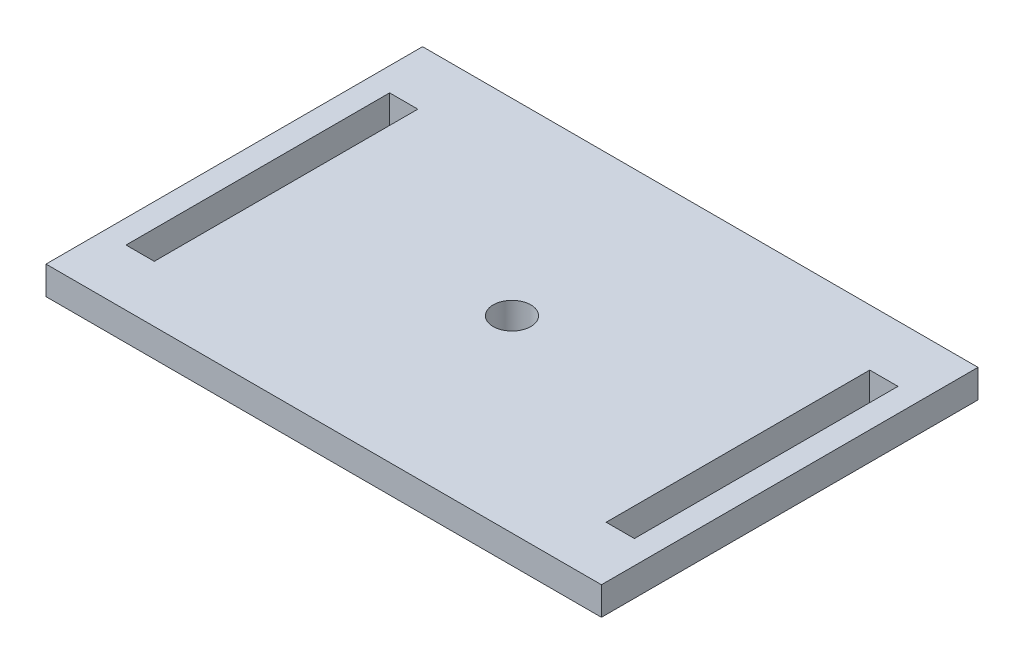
ISO-10303-21;
HEADER;
FILE_DESCRIPTION(('STEP AP214'),'2;1');
FILE_NAME('part.step','',(''),(''),'','','');
FILE_SCHEMA(('AUTOMOTIVE_DESIGN { 1 0 10303 214 1 1 1 1 }'));
ENDSEC;
DATA;
#1=APPLICATION_CONTEXT('core data for automotive mechanical design processes');
#2=APPLICATION_PROTOCOL_DEFINITION('international standard','automotive_design',2000,#1);
#3=PRODUCT_CONTEXT('',#1,'mechanical');
#4=PRODUCT('Part','Part','',(#3));
#5=PRODUCT_RELATED_PRODUCT_CATEGORY('part','',(#4));
#6=PRODUCT_DEFINITION_FORMATION('','',#4);
#7=PRODUCT_DEFINITION_CONTEXT('part definition',#1,'design');
#8=PRODUCT_DEFINITION('design','',#6,#7);
#9=PRODUCT_DEFINITION_SHAPE('','',#8);
#10=(LENGTH_UNIT() NAMED_UNIT(*) SI_UNIT(.MILLI.,.METRE.));
#11=(NAMED_UNIT(*) PLANE_ANGLE_UNIT() SI_UNIT($,.RADIAN.));
#12=(NAMED_UNIT(*) SI_UNIT($,.STERADIAN.) SOLID_ANGLE_UNIT());
#13=UNCERTAINTY_MEASURE_WITH_UNIT(LENGTH_MEASURE(1.E-05),#10,'distance_accuracy_value','');
#14=(GEOMETRIC_REPRESENTATION_CONTEXT(3) GLOBAL_UNCERTAINTY_ASSIGNED_CONTEXT((#13)) GLOBAL_UNIT_ASSIGNED_CONTEXT((#10,
#11,#12)) REPRESENTATION_CONTEXT('',''));
#15=CARTESIAN_POINT('',(0.,0.,0.));
#16=DIRECTION('',(0.,0.,1.));
#17=DIRECTION('',(1.,0.,0.));
#18=AXIS2_PLACEMENT_3D('',#15,#16,#17);
#19=CARTESIAN_POINT('',(29.5,3.,20.));
#20=DIRECTION('',(0.,1.,0.));
#21=DIRECTION('',(0.,0.,1.));
#22=AXIS2_PLACEMENT_3D('',#19,#20,#21);
#23=PLANE('',#22);
#24=DIRECTION('',(-1.,0.,0.));
#25=VECTOR('',#24,1.);
#26=CARTESIAN_POINT('',(-27.,3.,-14.));
#27=LINE('',#26,#25);
#28=CARTESIAN_POINT('',(-24.,3.,-14.));
#29=VERTEX_POINT('',#28);
#30=CARTESIAN_POINT('',(-27.,3.,-14.));
#31=VERTEX_POINT('',#30);
#32=EDGE_CURVE('E160',#29,#31,#27,.T.);
#33=ORIENTED_EDGE('',*,*,#32,.F.);
#34=DIRECTION('',(0.,0.,-1.));
#35=VECTOR('',#34,1.);
#36=CARTESIAN_POINT('',(-24.,3.,-14.));
#37=LINE('',#36,#35);
#38=CARTESIAN_POINT('',(-24.,3.,14.));
#39=VERTEX_POINT('',#38);
#40=EDGE_CURVE('E158',#39,#29,#37,.T.);
#41=ORIENTED_EDGE('',*,*,#40,.F.);
#42=DIRECTION('',(1.,0.,0.));
#43=VECTOR('',#42,1.);
#44=CARTESIAN_POINT('',(-27.,3.,14.));
#45=LINE('',#44,#43);
#46=CARTESIAN_POINT('',(-27.,3.,14.));
#47=VERTEX_POINT('',#46);
#48=EDGE_CURVE('E166',#47,#39,#45,.T.);
#49=ORIENTED_EDGE('',*,*,#48,.F.);
#50=DIRECTION('',(0.,0.,1.));
#51=VECTOR('',#50,1.);
#52=CARTESIAN_POINT('',(-27.,3.,-14.));
#53=LINE('',#52,#51);
#54=EDGE_CURVE('E163',#31,#47,#53,.T.);
#55=ORIENTED_EDGE('',*,*,#54,.F.);
#56=EDGE_LOOP('',(#33,#41,#49,#55));
#57=FACE_BOUND('',#56,.T.);
#58=DIRECTION('',(0.,0.,-1.));
#59=VECTOR('',#58,1.);
#60=CARTESIAN_POINT('',(29.5,3.,-20.));
#61=LINE('',#60,#59);
#62=CARTESIAN_POINT('',(29.5,3.,20.));
#63=VERTEX_POINT('',#62);
#64=CARTESIAN_POINT('',(29.5,3.,-20.));
#65=VERTEX_POINT('',#64);
#66=EDGE_CURVE('E195',#63,#65,#61,.T.);
#67=ORIENTED_EDGE('',*,*,#66,.T.);
#68=DIRECTION('',(-1.,0.,0.));
#69=VECTOR('',#68,1.);
#70=CARTESIAN_POINT('',(-29.5,3.,-20.));
#71=LINE('',#70,#69);
#72=CARTESIAN_POINT('',(-29.5,3.,-20.));
#73=VERTEX_POINT('',#72);
#74=EDGE_CURVE('E198',#65,#73,#71,.T.);
#75=ORIENTED_EDGE('',*,*,#74,.T.);
#76=DIRECTION('',(0.,0.,1.));
#77=VECTOR('',#76,1.);
#78=CARTESIAN_POINT('',(-29.5,3.,-20.));
#79=LINE('',#78,#77);
#80=CARTESIAN_POINT('',(-29.5,3.,20.));
#81=VERTEX_POINT('',#80);
#82=EDGE_CURVE('E201',#73,#81,#79,.T.);
#83=ORIENTED_EDGE('',*,*,#82,.T.);
#84=DIRECTION('',(1.,0.,0.));
#85=VECTOR('',#84,1.);
#86=CARTESIAN_POINT('',(-29.5,3.,20.));
#87=LINE('',#86,#85);
#88=EDGE_CURVE('E203',#81,#63,#87,.T.);
#89=ORIENTED_EDGE('',*,*,#88,.T.);
#90=EDGE_LOOP('',(#67,#75,#83,#89));
#91=FACE_BOUND('',#90,.T.);
#92=CARTESIAN_POINT('',(0.,3.,0.));
#93=DIRECTION('',(0.,1.,0.));
#94=DIRECTION('',(0.,0.,1.));
#95=AXIS2_PLACEMENT_3D('',#92,#93,#94);
#96=CIRCLE('',#95,2.);
#97=CARTESIAN_POINT('',(0.,3.,2.));
#98=VERTEX_POINT('',#97);
#99=EDGE_CURVE('E189',#98,#98,#96,.T.);
#100=ORIENTED_EDGE('',*,*,#99,.F.);
#101=EDGE_LOOP('',(#100));
#102=FACE_BOUND('',#101,.T.);
#103=DIRECTION('',(-1.,0.,0.));
#104=VECTOR('',#103,1.);
#105=CARTESIAN_POINT('',(27.,3.,-14.));
#106=LINE('',#105,#104);
#107=CARTESIAN_POINT('',(27.,3.,-14.));
#108=VERTEX_POINT('',#107);
#109=CARTESIAN_POINT('',(24.,3.,-14.));
#110=VERTEX_POINT('',#109);
#111=EDGE_CURVE('E130',#108,#110,#106,.T.);
#112=ORIENTED_EDGE('',*,*,#111,.F.);
#113=DIRECTION('',(0.,0.,-1.));
#114=VECTOR('',#113,1.);
#115=CARTESIAN_POINT('',(27.,3.,-14.));
#116=LINE('',#115,#114);
#117=CARTESIAN_POINT('',(27.,3.,14.));
#118=VERTEX_POINT('',#117);
#119=EDGE_CURVE('E122',#118,#108,#116,.T.);
#120=ORIENTED_EDGE('',*,*,#119,.F.);
#121=DIRECTION('',(1.,0.,0.));
#122=VECTOR('',#121,1.);
#123=CARTESIAN_POINT('',(27.,3.,14.));
#124=LINE('',#123,#122);
#125=CARTESIAN_POINT('',(24.,3.,14.));
#126=VERTEX_POINT('',#125);
#127=EDGE_CURVE('E144',#126,#118,#124,.T.);
#128=ORIENTED_EDGE('',*,*,#127,.F.);
#129=DIRECTION('',(0.,0.,1.));
#130=VECTOR('',#129,1.);
#131=CARTESIAN_POINT('',(24.,3.,-14.));
#132=LINE('',#131,#130);
#133=EDGE_CURVE('E142',#110,#126,#132,.T.);
#134=ORIENTED_EDGE('',*,*,#133,.F.);
#135=EDGE_LOOP('',(#112,#120,#128,#134));
#136=FACE_BOUND('',#135,.T.);
#137=ADVANCED_FACE('F33',(#57,#91,#102,#136),#23,.T.);
#138=CARTESIAN_POINT('',(29.5,0.,20.));
#139=DIRECTION('',(0.,1.,0.));
#140=DIRECTION('',(0.,0.,1.));
#141=AXIS2_PLACEMENT_3D('',#138,#139,#140);
#142=PLANE('',#141);
#143=DIRECTION('',(0.,0.,-1.));
#144=VECTOR('',#143,1.);
#145=CARTESIAN_POINT('',(-24.,0.,-14.));
#146=LINE('',#145,#144);
#147=CARTESIAN_POINT('',(-24.,0.,14.));
#148=VERTEX_POINT('',#147);
#149=CARTESIAN_POINT('',(-24.,0.,-14.));
#150=VERTEX_POINT('',#149);
#151=EDGE_CURVE('E138',#148,#150,#146,.T.);
#152=ORIENTED_EDGE('',*,*,#151,.T.);
#153=DIRECTION('',(-1.,0.,0.));
#154=VECTOR('',#153,1.);
#155=CARTESIAN_POINT('',(-27.,0.,-14.));
#156=LINE('',#155,#154);
#157=CARTESIAN_POINT('',(-27.,0.,-14.));
#158=VERTEX_POINT('',#157);
#159=EDGE_CURVE('E171',#150,#158,#156,.T.);
#160=ORIENTED_EDGE('',*,*,#159,.T.);
#161=DIRECTION('',(0.,0.,1.));
#162=VECTOR('',#161,1.);
#163=CARTESIAN_POINT('',(-27.,0.,-14.));
#164=LINE('',#163,#162);
#165=CARTESIAN_POINT('',(-27.,0.,14.));
#166=VERTEX_POINT('',#165);
#167=EDGE_CURVE('E174',#158,#166,#164,.T.);
#168=ORIENTED_EDGE('',*,*,#167,.T.);
#169=DIRECTION('',(1.,0.,0.));
#170=VECTOR('',#169,1.);
#171=CARTESIAN_POINT('',(-27.,0.,14.));
#172=LINE('',#171,#170);
#173=EDGE_CURVE('E161',#166,#148,#172,.T.);
#174=ORIENTED_EDGE('',*,*,#173,.T.);
#175=EDGE_LOOP('',(#152,#160,#168,#174));
#176=FACE_BOUND('',#175,.T.);
#177=DIRECTION('',(0.,0.,-1.));
#178=VECTOR('',#177,1.);
#179=CARTESIAN_POINT('',(29.5,0.,-20.));
#180=LINE('',#179,#178);
#181=CARTESIAN_POINT('',(29.5,0.,20.));
#182=VERTEX_POINT('',#181);
#183=CARTESIAN_POINT('',(29.5,0.,-20.));
#184=VERTEX_POINT('',#183);
#185=EDGE_CURVE('E192',#182,#184,#180,.T.);
#186=ORIENTED_EDGE('',*,*,#185,.F.);
#187=DIRECTION('',(1.,0.,0.));
#188=VECTOR('',#187,1.);
#189=CARTESIAN_POINT('',(-29.5,0.,20.));
#190=LINE('',#189,#188);
#191=CARTESIAN_POINT('',(-29.5,0.,20.));
#192=VERTEX_POINT('',#191);
#193=EDGE_CURVE('E199',#192,#182,#190,.T.);
#194=ORIENTED_EDGE('',*,*,#193,.F.);
#195=DIRECTION('',(0.,0.,1.));
#196=VECTOR('',#195,1.);
#197=CARTESIAN_POINT('',(-29.5,0.,-20.));
#198=LINE('',#197,#196);
#199=CARTESIAN_POINT('',(-29.5,0.,-20.));
#200=VERTEX_POINT('',#199);
#201=EDGE_CURVE('E210',#200,#192,#198,.T.);
#202=ORIENTED_EDGE('',*,*,#201,.F.);
#203=DIRECTION('',(-1.,0.,0.));
#204=VECTOR('',#203,1.);
#205=CARTESIAN_POINT('',(-29.5,0.,-20.));
#206=LINE('',#205,#204);
#207=EDGE_CURVE('E208',#184,#200,#206,.T.);
#208=ORIENTED_EDGE('',*,*,#207,.F.);
#209=EDGE_LOOP('',(#186,#194,#202,#208));
#210=FACE_BOUND('',#209,.T.);
#211=CARTESIAN_POINT('',(0.,0.,0.));
#212=DIRECTION('',(0.,1.,0.));
#213=DIRECTION('',(0.,0.,1.));
#214=AXIS2_PLACEMENT_3D('',#211,#212,#213);
#215=CIRCLE('',#214,2.);
#216=CARTESIAN_POINT('',(0.,0.,2.));
#217=VERTEX_POINT('',#216);
#218=EDGE_CURVE('E188',#217,#217,#215,.T.);
#219=ORIENTED_EDGE('',*,*,#218,.T.);
#220=EDGE_LOOP('',(#219));
#221=FACE_BOUND('',#220,.T.);
#222=DIRECTION('',(0.,0.,-1.));
#223=VECTOR('',#222,1.);
#224=CARTESIAN_POINT('',(27.,0.,-14.));
#225=LINE('',#224,#223);
#226=CARTESIAN_POINT('',(27.,0.,14.));
#227=VERTEX_POINT('',#226);
#228=CARTESIAN_POINT('',(27.,0.,-14.));
#229=VERTEX_POINT('',#228);
#230=EDGE_CURVE('E56',#227,#229,#225,.T.);
#231=ORIENTED_EDGE('',*,*,#230,.T.);
#232=DIRECTION('',(-1.,0.,0.));
#233=VECTOR('',#232,1.);
#234=CARTESIAN_POINT('',(27.,0.,-14.));
#235=LINE('',#234,#233);
#236=CARTESIAN_POINT('',(24.,0.,-14.));
#237=VERTEX_POINT('',#236);
#238=EDGE_CURVE('E137',#229,#237,#235,.T.);
#239=ORIENTED_EDGE('',*,*,#238,.T.);
#240=DIRECTION('',(0.,0.,1.));
#241=VECTOR('',#240,1.);
#242=CARTESIAN_POINT('',(24.,0.,-14.));
#243=LINE('',#242,#241);
#244=CARTESIAN_POINT('',(24.,0.,14.));
#245=VERTEX_POINT('',#244);
#246=EDGE_CURVE('E150',#237,#245,#243,.T.);
#247=ORIENTED_EDGE('',*,*,#246,.T.);
#248=DIRECTION('',(1.,0.,0.));
#249=VECTOR('',#248,1.);
#250=CARTESIAN_POINT('',(27.,0.,14.));
#251=LINE('',#250,#249);
#252=EDGE_CURVE('E131',#245,#227,#251,.T.);
#253=ORIENTED_EDGE('',*,*,#252,.T.);
#254=EDGE_LOOP('',(#231,#239,#247,#253));
#255=FACE_BOUND('',#254,.T.);
#256=ADVANCED_FACE('F228',(#176,#210,#221,#255),#142,.F.);
#257=CARTESIAN_POINT('',(29.5,3.,-20.));
#258=DIRECTION('',(-1.,0.,0.));
#259=DIRECTION('',(0.,0.,1.));
#260=AXIS2_PLACEMENT_3D('',#257,#258,#259);
#261=PLANE('',#260);
#262=ORIENTED_EDGE('',*,*,#185,.T.);
#263=DIRECTION('',(0.,-1.,0.));
#264=VECTOR('',#263,1.);
#265=CARTESIAN_POINT('',(29.5,3.,-20.));
#266=LINE('',#265,#264);
#267=EDGE_CURVE('E11',#65,#184,#266,.T.);
#268=ORIENTED_EDGE('',*,*,#267,.F.);
#269=ORIENTED_EDGE('',*,*,#66,.F.);
#270=DIRECTION('',(0.,-1.,0.));
#271=VECTOR('',#270,1.);
#272=CARTESIAN_POINT('',(29.5,3.,20.));
#273=LINE('',#272,#271);
#274=EDGE_CURVE('E205',#63,#182,#273,.T.);
#275=ORIENTED_EDGE('',*,*,#274,.T.);
#276=EDGE_LOOP('',(#262,#268,#269,#275));
#277=FACE_BOUND('',#276,.T.);
#278=ADVANCED_FACE('F35',(#277),#261,.F.);
#279=CARTESIAN_POINT('',(-29.5,3.,-20.));
#280=DIRECTION('',(0.,0.,1.));
#281=DIRECTION('',(1.,0.,0.));
#282=AXIS2_PLACEMENT_3D('',#279,#280,#281);
#283=PLANE('',#282);
#284=ORIENTED_EDGE('',*,*,#207,.T.);
#285=DIRECTION('',(0.,-1.,0.));
#286=VECTOR('',#285,1.);
#287=CARTESIAN_POINT('',(-29.5,3.,-20.));
#288=LINE('',#287,#286);
#289=EDGE_CURVE('E41',#73,#200,#288,.T.);
#290=ORIENTED_EDGE('',*,*,#289,.F.);
#291=ORIENTED_EDGE('',*,*,#74,.F.);
#292=ORIENTED_EDGE('',*,*,#267,.T.);
#293=EDGE_LOOP('',(#284,#290,#291,#292));
#294=FACE_BOUND('',#293,.T.);
#295=ADVANCED_FACE('F239',(#294),#283,.F.);
#296=CARTESIAN_POINT('',(-29.5,3.,-20.));
#297=DIRECTION('',(1.,0.,0.));
#298=DIRECTION('',(0.,0.,-1.));
#299=AXIS2_PLACEMENT_3D('',#296,#297,#298);
#300=PLANE('',#299);
#301=ORIENTED_EDGE('',*,*,#201,.T.);
#302=DIRECTION('',(0.,-1.,0.));
#303=VECTOR('',#302,1.);
#304=CARTESIAN_POINT('',(-29.5,3.,20.));
#305=LINE('',#304,#303);
#306=EDGE_CURVE('E215',#81,#192,#305,.T.);
#307=ORIENTED_EDGE('',*,*,#306,.F.);
#308=ORIENTED_EDGE('',*,*,#82,.F.);
#309=ORIENTED_EDGE('',*,*,#289,.T.);
#310=EDGE_LOOP('',(#301,#307,#308,#309));
#311=FACE_BOUND('',#310,.T.);
#312=ADVANCED_FACE('F222',(#311),#300,.F.);
#313=CARTESIAN_POINT('',(-29.5,3.,20.));
#314=DIRECTION('',(0.,0.,-1.));
#315=DIRECTION('',(-1.,0.,0.));
#316=AXIS2_PLACEMENT_3D('',#313,#314,#315);
#317=PLANE('',#316);
#318=ORIENTED_EDGE('',*,*,#193,.T.);
#319=ORIENTED_EDGE('',*,*,#274,.F.);
#320=ORIENTED_EDGE('',*,*,#88,.F.);
#321=ORIENTED_EDGE('',*,*,#306,.T.);
#322=EDGE_LOOP('',(#318,#319,#320,#321));
#323=FACE_BOUND('',#322,.T.);
#324=ADVANCED_FACE('F232',(#323),#317,.F.);
#325=CARTESIAN_POINT('',(0.,3.,0.));
#326=DIRECTION('',(0.,-1.,0.));
#327=DIRECTION('',(0.,0.,-1.));
#328=AXIS2_PLACEMENT_3D('',#325,#326,#327);
#329=CYLINDRICAL_SURFACE('',#328,2.);
#330=ORIENTED_EDGE('',*,*,#99,.T.);
#331=EDGE_LOOP('',(#330));
#332=FACE_BOUND('',#331,.T.);
#333=ORIENTED_EDGE('',*,*,#218,.F.);
#334=EDGE_LOOP('',(#333));
#335=FACE_BOUND('',#334,.T.);
#336=ADVANCED_FACE('F256',(#332,#335),#329,.F.);
#337=CARTESIAN_POINT('',(-24.,3.,-14.));
#338=DIRECTION('',(-1.,0.,0.));
#339=DIRECTION('',(0.,0.,1.));
#340=AXIS2_PLACEMENT_3D('',#337,#338,#339);
#341=PLANE('',#340);
#342=ORIENTED_EDGE('',*,*,#151,.F.);
#343=DIRECTION('',(0.,-1.,0.));
#344=VECTOR('',#343,1.);
#345=CARTESIAN_POINT('',(-24.,3.,14.));
#346=LINE('',#345,#344);
#347=EDGE_CURVE('E168',#39,#148,#346,.T.);
#348=ORIENTED_EDGE('',*,*,#347,.F.);
#349=ORIENTED_EDGE('',*,*,#40,.T.);
#350=DIRECTION('',(0.,-1.,0.));
#351=VECTOR('',#350,1.);
#352=CARTESIAN_POINT('',(-24.,3.,-14.));
#353=LINE('',#352,#351);
#354=EDGE_CURVE('E185',#29,#150,#353,.T.);
#355=ORIENTED_EDGE('',*,*,#354,.T.);
#356=EDGE_LOOP('',(#342,#348,#349,#355));
#357=FACE_BOUND('',#356,.T.);
#358=ADVANCED_FACE('F263',(#357),#341,.T.);
#359=CARTESIAN_POINT('',(-27.,3.,-14.));
#360=DIRECTION('',(0.,0.,1.));
#361=DIRECTION('',(1.,0.,0.));
#362=AXIS2_PLACEMENT_3D('',#359,#360,#361);
#363=PLANE('',#362);
#364=ORIENTED_EDGE('',*,*,#159,.F.);
#365=ORIENTED_EDGE('',*,*,#354,.F.);
#366=ORIENTED_EDGE('',*,*,#32,.T.);
#367=DIRECTION('',(0.,-1.,0.));
#368=VECTOR('',#367,1.);
#369=CARTESIAN_POINT('',(-27.,3.,-14.));
#370=LINE('',#369,#368);
#371=EDGE_CURVE('E183',#31,#158,#370,.T.);
#372=ORIENTED_EDGE('',*,*,#371,.T.);
#373=EDGE_LOOP('',(#364,#365,#366,#372));
#374=FACE_BOUND('',#373,.T.);
#375=ADVANCED_FACE('F268',(#374),#363,.T.);
#376=CARTESIAN_POINT('',(-27.,3.,-14.));
#377=DIRECTION('',(1.,0.,0.));
#378=DIRECTION('',(0.,0.,-1.));
#379=AXIS2_PLACEMENT_3D('',#376,#377,#378);
#380=PLANE('',#379);
#381=ORIENTED_EDGE('',*,*,#167,.F.);
#382=ORIENTED_EDGE('',*,*,#371,.F.);
#383=ORIENTED_EDGE('',*,*,#54,.T.);
#384=DIRECTION('',(0.,-1.,0.));
#385=VECTOR('',#384,1.);
#386=CARTESIAN_POINT('',(-27.,3.,14.));
#387=LINE('',#386,#385);
#388=EDGE_CURVE('E181',#47,#166,#387,.T.);
#389=ORIENTED_EDGE('',*,*,#388,.T.);
#390=EDGE_LOOP('',(#381,#382,#383,#389));
#391=FACE_BOUND('',#390,.T.);
#392=ADVANCED_FACE('F292',(#391),#380,.T.);
#393=CARTESIAN_POINT('',(-27.,3.,14.));
#394=DIRECTION('',(0.,0.,-1.));
#395=DIRECTION('',(-1.,0.,0.));
#396=AXIS2_PLACEMENT_3D('',#393,#394,#395);
#397=PLANE('',#396);
#398=ORIENTED_EDGE('',*,*,#173,.F.);
#399=ORIENTED_EDGE('',*,*,#388,.F.);
#400=ORIENTED_EDGE('',*,*,#48,.T.);
#401=ORIENTED_EDGE('',*,*,#347,.T.);
#402=EDGE_LOOP('',(#398,#399,#400,#401));
#403=FACE_BOUND('',#402,.T.);
#404=ADVANCED_FACE('F289',(#403),#397,.T.);
#405=CARTESIAN_POINT('',(27.,3.,-14.));
#406=DIRECTION('',(-1.,0.,0.));
#407=DIRECTION('',(0.,0.,1.));
#408=AXIS2_PLACEMENT_3D('',#405,#406,#407);
#409=PLANE('',#408);
#410=ORIENTED_EDGE('',*,*,#230,.F.);
#411=DIRECTION('',(0.,-1.,0.));
#412=VECTOR('',#411,1.);
#413=CARTESIAN_POINT('',(27.,3.,14.));
#414=LINE('',#413,#412);
#415=EDGE_CURVE('E126',#118,#227,#414,.T.);
#416=ORIENTED_EDGE('',*,*,#415,.F.);
#417=ORIENTED_EDGE('',*,*,#119,.T.);
#418=DIRECTION('',(0.,-1.,0.));
#419=VECTOR('',#418,1.);
#420=CARTESIAN_POINT('',(27.,3.,-14.));
#421=LINE('',#420,#419);
#422=EDGE_CURVE('E125',#108,#229,#421,.T.);
#423=ORIENTED_EDGE('',*,*,#422,.T.);
#424=EDGE_LOOP('',(#410,#416,#417,#423));
#425=FACE_BOUND('',#424,.T.);
#426=ADVANCED_FACE('F124',(#425),#409,.T.);
#427=CARTESIAN_POINT('',(27.,3.,-14.));
#428=DIRECTION('',(0.,0.,1.));
#429=DIRECTION('',(1.,0.,0.));
#430=AXIS2_PLACEMENT_3D('',#427,#428,#429);
#431=PLANE('',#430);
#432=ORIENTED_EDGE('',*,*,#238,.F.);
#433=ORIENTED_EDGE('',*,*,#422,.F.);
#434=ORIENTED_EDGE('',*,*,#111,.T.);
#435=DIRECTION('',(0.,-1.,0.));
#436=VECTOR('',#435,1.);
#437=CARTESIAN_POINT('',(24.,3.,-14.));
#438=LINE('',#437,#436);
#439=EDGE_CURVE('E139',#110,#237,#438,.T.);
#440=ORIENTED_EDGE('',*,*,#439,.T.);
#441=EDGE_LOOP('',(#432,#433,#434,#440));
#442=FACE_BOUND('',#441,.T.);
#443=ADVANCED_FACE('F134',(#442),#431,.T.);
#444=CARTESIAN_POINT('',(24.,3.,-14.));
#445=DIRECTION('',(1.,0.,0.));
#446=DIRECTION('',(0.,0.,-1.));
#447=AXIS2_PLACEMENT_3D('',#444,#445,#446);
#448=PLANE('',#447);
#449=ORIENTED_EDGE('',*,*,#246,.F.);
#450=ORIENTED_EDGE('',*,*,#439,.F.);
#451=ORIENTED_EDGE('',*,*,#133,.T.);
#452=DIRECTION('',(0.,-1.,0.));
#453=VECTOR('',#452,1.);
#454=CARTESIAN_POINT('',(24.,3.,14.));
#455=LINE('',#454,#453);
#456=EDGE_CURVE('E48',#126,#245,#455,.T.);
#457=ORIENTED_EDGE('',*,*,#456,.T.);
#458=EDGE_LOOP('',(#449,#450,#451,#457));
#459=FACE_BOUND('',#458,.T.);
#460=ADVANCED_FACE('F277',(#459),#448,.T.);
#461=CARTESIAN_POINT('',(27.,3.,14.));
#462=DIRECTION('',(0.,0.,-1.));
#463=DIRECTION('',(-1.,0.,0.));
#464=AXIS2_PLACEMENT_3D('',#461,#462,#463);
#465=PLANE('',#464);
#466=ORIENTED_EDGE('',*,*,#252,.F.);
#467=ORIENTED_EDGE('',*,*,#456,.F.);
#468=ORIENTED_EDGE('',*,*,#127,.T.);
#469=ORIENTED_EDGE('',*,*,#415,.T.);
#470=EDGE_LOOP('',(#466,#467,#468,#469));
#471=FACE_BOUND('',#470,.T.);
#472=ADVANCED_FACE('F275',(#471),#465,.T.);
#473=CLOSED_SHELL('',(#137,#256,#278,#295,#312,#324,#336,#358,#375,#392,#404,#426,#443,#460,#472));
#474=MANIFOLD_SOLID_BREP('B2',#473);
#475=ADVANCED_BREP_SHAPE_REPRESENTATION('',(#18,#474),#14);
#476=SHAPE_DEFINITION_REPRESENTATION(#9,#475);
ENDSEC;
END-ISO-10303-21;
